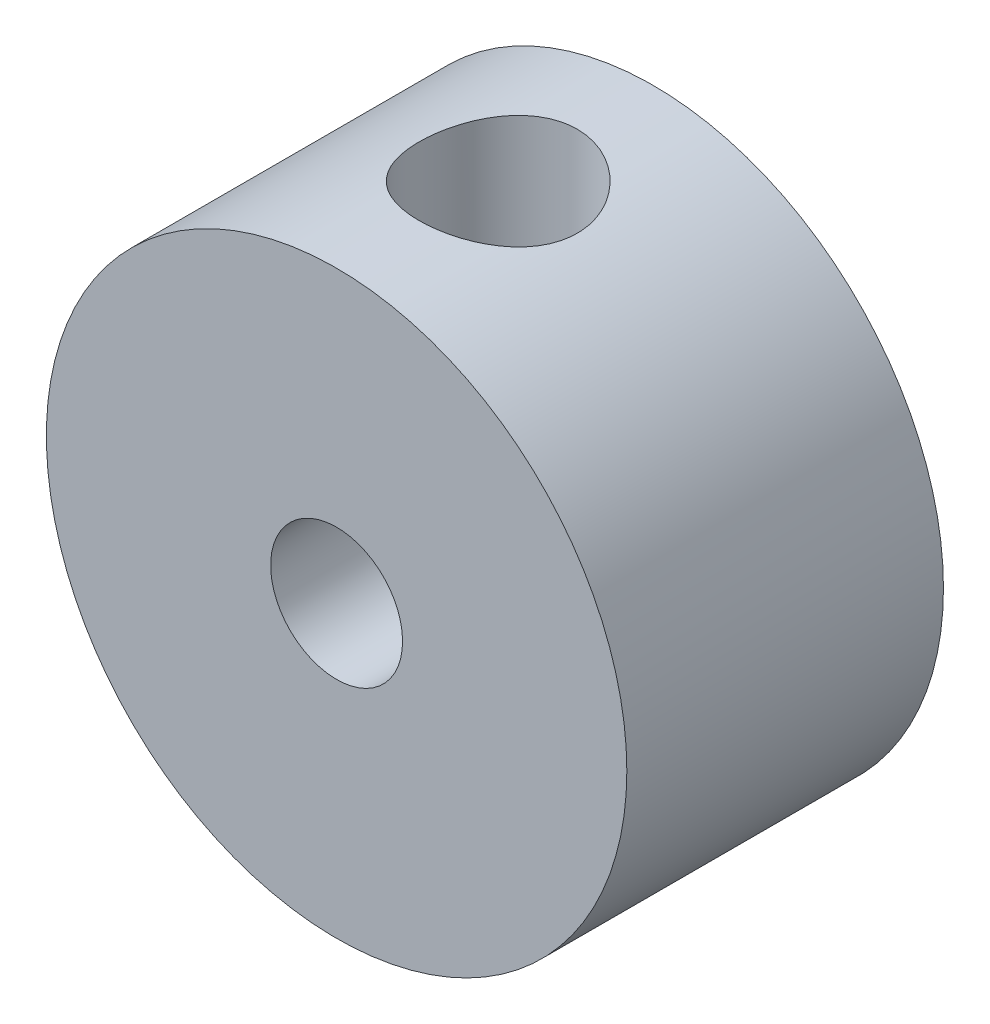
from build123d import *

# Parameters (mm, degrees)
CROQUIS1_R                 = 5.5
CROQUIS1_R_2               = 1.25
SALIENTE_EXTRUIR1_DEPTH    = 6
CORTAR_EXTRUIR1_REACH      = 11.823
CORTAR_EXTRUIR1_END_RADIUS = 5.5
CROQUIS2_R                 = 1.5


with BuildPart() as part:
    # Croquis1 → Saliente-Extruir1 (new body)
    with BuildSketch(Plane.XY):
        Circle(CROQUIS1_R)
        Circle(CROQUIS1_R_2, mode=Mode.SUBTRACT)
    extrude(amount=SALIENTE_EXTRUIR1_DEPTH)

    # Cortar-Extruir1: up to this cylinder (the profile starts inside it)
    cortar_extruir1_end = Plane(origin=(0, 0, 2.938282), z_dir=(0, 0, -1)) * Cylinder(CORTAR_EXTRUIR1_END_RADIUS, 35.646, mode=Mode.PRIVATE)
    # Croquis2 → Cortar-Extruir1 (cut, up to the surface)
    with BuildSketch(Plane(origin=(0, 0, 0), x_dir=(1, 0, 0), z_dir=(0, 1, 0)), mode=Mode.PRIVATE) as cortar_extruir1_sk1:
        with Locations(Location((0, -2.93828193, 0), (0, 0, 90))):
            Circle(CROQUIS2_R)
    cortar_extruir1_tool1 = extrude(cortar_extruir1_sk1.sketch, amount=CORTAR_EXTRUIR1_REACH, mode=Mode.PRIVATE) & cortar_extruir1_end
    add(cortar_extruir1_tool1.solids().sort_by_distance((0, 0, 2.938282))[0], mode=Mode.SUBTRACT)


solid = part.part
